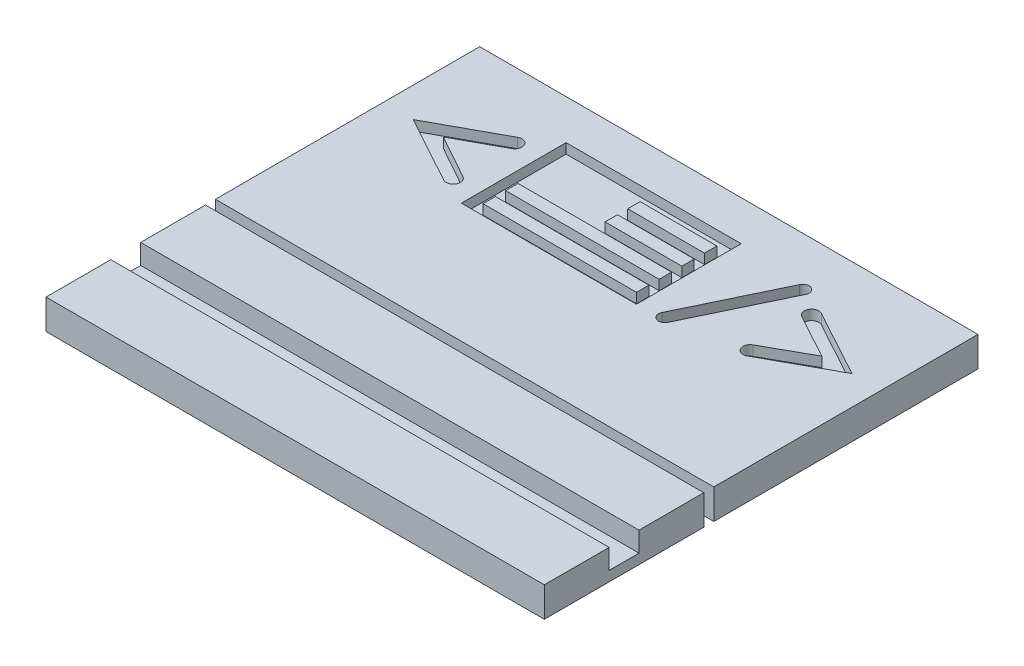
from build123d import *

# Parameters (mm, degrees)
SKETCH3_W           = 317.5
SKETCH3_H           = 508
BOSS_EXTRUDE3_DEPTH = 19.05
SKETCH2_W           = 111.556034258
SKETCH2_H           = 66.753439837
SKETCH2_W_2         = 48.913030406
SKETCH2_H_2         = 7.894734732
SKETCH2_H_3         = 7.894734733
SKETCH2_W_3         = 97.826060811
CUT_EXTRUDE1_DEPTH  = 6.35
SKETCH4_W           = 317.5
SKETCH4_H           = 6.35
CUT_EXTRUDE2_DEPTH  = 19.05
SKETCH5_W           = 317.5
SKETCH5_H           = 6.35
CUT_EXTRUDE3_DEPTH  = 19.05
SKETCH6_W           = 317.5
SKETCH6_H           = 19.05
CUT_EXTRUDE4_DEPTH  = 12.7
SKETCH7_W           = 317.5
SKETCH7_H           = 225.346560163
CUT_EXTRUDE5_DEPTH  = 600.360619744
SKETCH9_W           = 12.7
SKETCH9_H           = 6.35
BOSS_EXTRUDE4_DEPTH = 3.175


with BuildPart() as part:
    # Sketch3 → Boss-Extrude3 (new body)
    with BuildSketch(Plane(origin=(0, 0, 0), x_dir=(1, 0, 0), z_dir=(0, 1, 0))):
        with Locations((158.75, 254)):
            Rectangle(SKETCH3_W, SKETCH3_H)
    extrude(amount=-BOSS_EXTRUDE3_DEPTH)

    # Sketch2 → Cut-Extrude1 (cut)
    # profile 1 of 4: a face of its own
    with BuildSketch(Plane(origin=(0, 0, 0), x_dir=(1, 0, 0), z_dir=(0, 1, 0))):
        with BuildLine():
            Line((19.05, 446.626011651), (62.052938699, 470.081382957))
            ThreePointArc((62.052938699, 470.081382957), (68.293897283, 468.245712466), (66.458226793, 462.004753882))
            Line((66.458226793, 462.004753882), (38.262931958, 446.626011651))
            Line((38.262931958, 446.626011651), (66.458226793, 430.89375041))
            ThreePointArc((66.458226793, 430.89375041), (68.203152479, 424.74353663), (62.052938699, 422.998610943))
            Line((62.052938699, 422.998610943), (19.05, 446.626011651))
        make_face()
    # profile 2 of 4: a face of its own
    with BuildSketch(Plane(origin=(0, 0, 0), x_dir=(1, 0, 0), z_dir=(0, 1, 0))):
        with BuildLine():
            Line((233.218610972, 478.703860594), (204.730246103, 419.366293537))
            ThreePointArc((204.730246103, 419.366293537), (206.635953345, 413.940852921), (212.061393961, 415.846560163))
            Line((212.061393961, 415.846560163), (240.54975883, 475.18412722))
            ThreePointArc((240.54975883, 475.18412722), (238.644051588, 480.609567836), (233.218610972, 478.703860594))
        make_face()
    # profile 3 of 4: a face of its own
    with BuildSketch(Plane(origin=(0, 0, 0), x_dir=(1, 0, 0), z_dir=(0, 1, 0))):
        with Locations((136.252003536, 449.223280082)):
            Rectangle(SKETCH2_W, SKETCH2_H)
        with Locations((161.051768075, 455.246864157)):
            Rectangle(SKETCH2_W_2, SKETCH2_H_2, mode=Mode.SUBTRACT)
        with Locations((161.051768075, 469.674351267)):
            Rectangle(SKETCH2_W_2, SKETCH2_H_3, mode=Mode.SUBTRACT)
        with Locations((136.595252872, 426.391889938)):
            Rectangle(SKETCH2_W_3, SKETCH2_H_2, mode=Mode.SUBTRACT)
        with Locations((136.595252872, 440.819377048)):
            Rectangle(SKETCH2_W_3, SKETCH2_H_2, mode=Mode.SUBTRACT)
    # profile 4 of 4: a face of its own
    with BuildSketch(Plane(origin=(0, 0, 0), x_dir=(1, 0, 0), z_dir=(0, 1, 0))):
        with BuildLine():
            Line((279.752110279, 446.252948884), (251.556815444, 430.520687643))
            ThreePointArc((251.556815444, 430.520687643), (249.811889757, 424.370473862), (255.962103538, 422.625548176))
            Line((255.962103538, 422.625548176), (298.965042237, 446.252948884))
            Line((298.965042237, 446.252948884), (255.962103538, 469.70832019))
            ThreePointArc((255.962103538, 469.70832019), (249.721144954, 467.872649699), (251.556815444, 461.631691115))
            Line((251.556815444, 461.631691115), (279.752110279, 446.252948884))
        make_face()
    extrude(amount=-CUT_EXTRUDE1_DEPTH, mode=Mode.SUBTRACT)

    # Sketch4 → Cut-Extrude2 (cut)
    with BuildSketch(Plane(origin=(0, 0, 0), x_dir=(1, 0, 0), z_dir=(0, 1, 0))):
        with Locations((158.75, 336.471560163)):
            Rectangle(SKETCH4_W, SKETCH4_H)
    extrude(amount=-CUT_EXTRUDE2_DEPTH, mode=Mode.SUBTRACT)


with BuildPart() as cut_extrude2_piece_1:
    # of the separate pieces the step leaves, piece 1, a body of its own (cut_extrude2_pieces)
    add(part.part.solids().sort_by_distance((0, 0, 0))[0])

    # Sketch5 → Cut-Extrude3 (cut)
    with BuildSketch(Plane(origin=(0, 0, 0), x_dir=(1, 0, 0), z_dir=(0, 1, 0))):
        with Locations((158.75, 228.521560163)):
            Rectangle(SKETCH5_W, SKETCH5_H)
    extrude(amount=-CUT_EXTRUDE3_DEPTH, mode=Mode.SUBTRACT)


with BuildPart() as cut_extrude2_piece_2:
    # of the separate pieces the step leaves, piece 2, a body of its own (cut_extrude2_pieces)
    add(part.part.solids().sort_by_distance((0, 0, -508))[0])



with BuildPart() as cut_extrude3_piece_1:
    # of the separate pieces the step leaves, piece 1, a body of its own (cut_extrude3_pieces)
    add(cut_extrude2_piece_1.part.solids().sort_by_distance((0, 0, 0))[0])

    # Sketch7 → Cut-Extrude5 (cut, through all)
    with BuildSketch(Plane(origin=(0, 0, 0), x_dir=(1, 0, 0), z_dir=(0, 1, 0))):
        with Locations((158.75, 112.673280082)):
            Rectangle(SKETCH7_W, SKETCH7_H)
    extrude(amount=-CUT_EXTRUDE5_DEPTH, mode=Mode.SUBTRACT)


with BuildPart() as cut_extrude3_piece_2:
    # of the separate pieces the step leaves, piece 2, a body of its own (cut_extrude3_pieces)
    add(cut_extrude2_piece_1.part.solids().sort_by_distance((0, 0, -231.696560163))[0])

    # Sketch6 → Cut-Extrude4 (cut)
    with BuildSketch(Plane(origin=(0, 0, 0), x_dir=(1, 0, 0), z_dir=(0, 1, 0))):
        with Locations((158.75, 282.496560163)):
            Rectangle(SKETCH6_W, SKETCH6_H)
    extrude(amount=-CUT_EXTRUDE4_DEPTH, mode=Mode.SUBTRACT)


with BuildPart() as cut_extrude2_piece_2_1:
    add(cut_extrude2_piece_2.part)

    add(cut_extrude3_piece_2.part)  # Boss-Extrude4 merges Cut-Extrude3 piece 2
    # Sketch9 → Boss-Extrude4 (add)
    with BuildSketch(Plane.XZ.offset(19.05)):
        with Locations((285.75, -336.471560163)):
            Rectangle(SKETCH9_W, SKETCH9_H)
        with Locations((158.75, -336.471560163)):
            Rectangle(SKETCH9_W, SKETCH9_H)
        with Locations((31.75, -336.471560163)):
            Rectangle(SKETCH9_W, SKETCH9_H)
    extrude(amount=-BOSS_EXTRUDE4_DEPTH)


solid = cut_extrude2_piece_2_1.part
